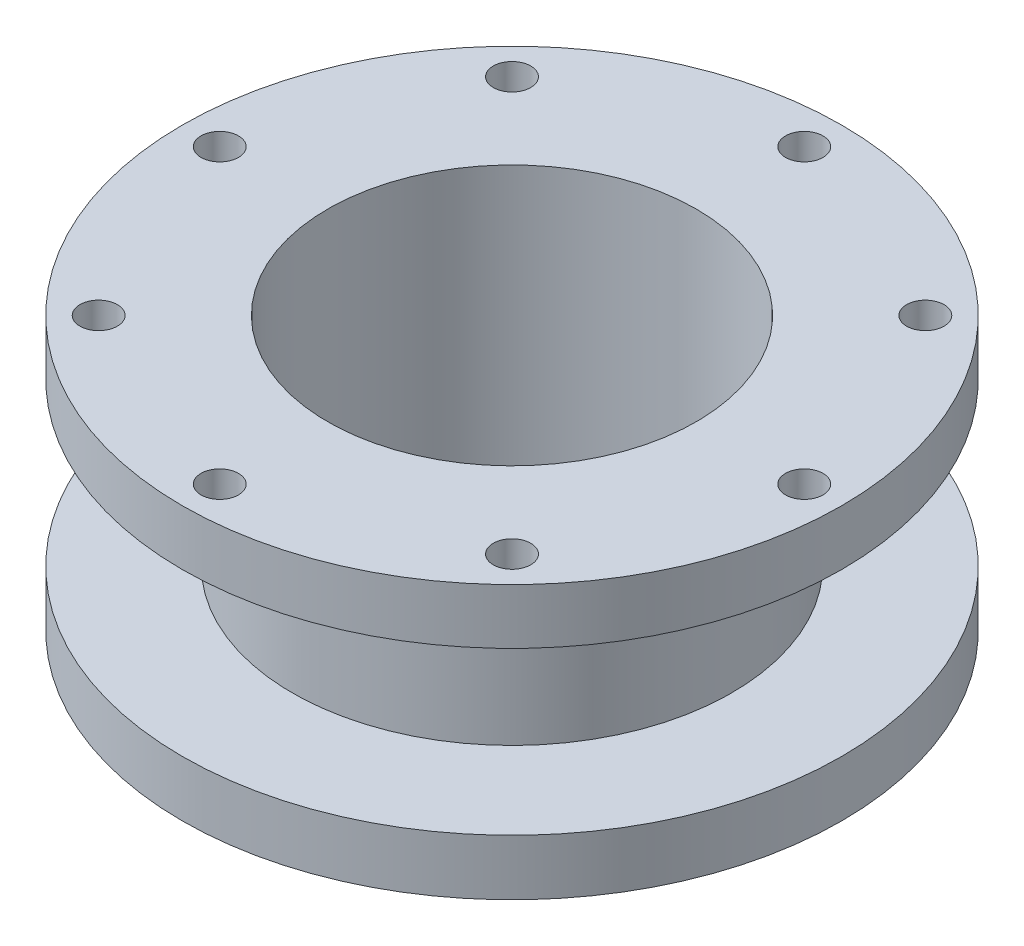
ISO-10303-21;
HEADER;
FILE_DESCRIPTION(('STEP AP214'),'2;1');
FILE_NAME('part.step','',(''),(''),'','','');
FILE_SCHEMA(('AUTOMOTIVE_DESIGN { 1 0 10303 214 1 1 1 1 }'));
ENDSEC;
DATA;
#1=APPLICATION_CONTEXT('core data for automotive mechanical design processes');
#2=APPLICATION_PROTOCOL_DEFINITION('international standard','automotive_design',2000,#1);
#3=PRODUCT_CONTEXT('',#1,'mechanical');
#4=PRODUCT('Part','Part','',(#3));
#5=PRODUCT_RELATED_PRODUCT_CATEGORY('part','',(#4));
#6=PRODUCT_DEFINITION_FORMATION('','',#4);
#7=PRODUCT_DEFINITION_CONTEXT('part definition',#1,'design');
#8=PRODUCT_DEFINITION('design','',#6,#7);
#9=PRODUCT_DEFINITION_SHAPE('','',#8);
#10=(LENGTH_UNIT() NAMED_UNIT(*) SI_UNIT(.MILLI.,.METRE.));
#11=(NAMED_UNIT(*) PLANE_ANGLE_UNIT() SI_UNIT($,.RADIAN.));
#12=(NAMED_UNIT(*) SI_UNIT($,.STERADIAN.) SOLID_ANGLE_UNIT());
#13=UNCERTAINTY_MEASURE_WITH_UNIT(LENGTH_MEASURE(1.E-05),#10,'distance_accuracy_value','');
#14=(GEOMETRIC_REPRESENTATION_CONTEXT(3) GLOBAL_UNCERTAINTY_ASSIGNED_CONTEXT((#13)) GLOBAL_UNIT_ASSIGNED_CONTEXT((#10,
#11,#12)) REPRESENTATION_CONTEXT('',''));
#15=CARTESIAN_POINT('',(0.,0.,0.));
#16=DIRECTION('',(0.,0.,1.));
#17=DIRECTION('',(1.,0.,0.));
#18=AXIS2_PLACEMENT_3D('',#15,#16,#17);
#19=CARTESIAN_POINT('',(-57.2500000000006,12.6,1.11022302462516E-13));
#20=DIRECTION('',(0.,1.,0.));
#21=DIRECTION('',(0.,0.,1.00000000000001));
#22=AXIS2_PLACEMENT_3D('',#19,#20,#21);
#23=PLANE('',#22);
#24=CARTESIAN_POINT('',(1.66533453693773E-13,12.6,0.));
#25=DIRECTION('',(0.,-1.,0.));
#26=DIRECTION('',(0.,0.,-1.00000000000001));
#27=AXIS2_PLACEMENT_3D('',#24,#25,#26);
#28=CIRCLE('',#27,32.);
#29=CARTESIAN_POINT('',(1.66533453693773E-13,12.6,-32.0000000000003));
#30=VERTEX_POINT('',#29);
#31=EDGE_CURVE('E10',#30,#30,#28,.T.);
#32=ORIENTED_EDGE('',*,*,#31,.F.);
#33=EDGE_LOOP('',(#32));
#34=FACE_BOUND('',#33,.T.);
#35=CARTESIAN_POINT('',(1.66533453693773E-13,12.6,0.));
#36=DIRECTION('',(0.,-1.,0.));
#37=DIRECTION('',(0.,0.,-1.00000000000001));
#38=AXIS2_PLACEMENT_3D('',#35,#36,#37);
#39=CIRCLE('',#38,57.25);
#40=CARTESIAN_POINT('',(1.66533453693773E-13,12.6,-57.2500000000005));
#41=VERTEX_POINT('',#40);
#42=EDGE_CURVE('E55',#41,#41,#39,.T.);
#43=ORIENTED_EDGE('',*,*,#42,.T.);
#44=EDGE_LOOP('',(#43));
#45=FACE_BOUND('',#44,.T.);
#46=ADVANCED_FACE('F36',(#34,#45),#23,.F.);
#47=CARTESIAN_POINT('',(0.,0.,0.));
#48=DIRECTION('',(0.,-1.,0.));
#49=DIRECTION('',(0.,0.,-1.00000000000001));
#50=AXIS2_PLACEMENT_3D('',#47,#48,#49);
#51=CYLINDRICAL_SURFACE('',#50,32.);
#52=CARTESIAN_POINT('',(1.11022302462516E-13,60.,0.));
#53=DIRECTION('',(0.,-1.,0.));
#54=DIRECTION('',(0.,0.,-1.00000000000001));
#55=AXIS2_PLACEMENT_3D('',#52,#53,#54);
#56=CIRCLE('',#55,32.);
#57=CARTESIAN_POINT('',(1.11022302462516E-13,60.,-32.0000000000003));
#58=VERTEX_POINT('',#57);
#59=EDGE_CURVE('E43',#58,#58,#56,.T.);
#60=ORIENTED_EDGE('',*,*,#59,.F.);
#61=EDGE_LOOP('',(#60));
#62=FACE_BOUND('',#61,.T.);
#63=ORIENTED_EDGE('',*,*,#31,.T.);
#64=EDGE_LOOP('',(#63));
#65=FACE_BOUND('',#64,.T.);
#66=ADVANCED_FACE('F122',(#62,#65),#51,.F.);
#67=CARTESIAN_POINT('',(-32.0000000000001,59.9999999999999,0.));
#68=DIRECTION('',(0.,-1.,0.));
#69=DIRECTION('',(0.,0.,-1.00000000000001));
#70=AXIS2_PLACEMENT_3D('',#67,#68,#69);
#71=PLANE('',#70);
#72=CARTESIAN_POINT('',(35.8856691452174,60.,35.8856691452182));
#73=DIRECTION('',(0.,1.,0.));
#74=DIRECTION('',(0.,0.,1.00000000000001));
#75=AXIS2_PLACEMENT_3D('',#72,#73,#74);
#76=CIRCLE('',#75,3.25);
#77=CARTESIAN_POINT('',(35.8856691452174,60.,39.1356691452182));
#78=VERTEX_POINT('',#77);
#79=EDGE_CURVE('E88',#78,#78,#76,.T.);
#80=ORIENTED_EDGE('',*,*,#79,.F.);
#81=EDGE_LOOP('',(#80));
#82=FACE_BOUND('',#81,.T.);
#83=CARTESIAN_POINT('',(50.7500000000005,59.9999999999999,5.96744875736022E-13));
#84=DIRECTION('',(0.,1.,0.));
#85=DIRECTION('',(0.,0.,1.00000000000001));
#86=AXIS2_PLACEMENT_3D('',#83,#84,#85);
#87=CIRCLE('',#86,3.25);
#88=CARTESIAN_POINT('',(50.7500000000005,59.9999999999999,3.25000000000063));
#89=VERTEX_POINT('',#88);
#90=EDGE_CURVE('E78',#89,#89,#87,.T.);
#91=ORIENTED_EDGE('',*,*,#90,.F.);
#92=EDGE_LOOP('',(#91));
#93=FACE_BOUND('',#92,.T.);
#94=CARTESIAN_POINT('',(35.8856691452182,60.0000000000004,-35.8856691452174));
#95=DIRECTION('',(0.,1.,0.));
#96=DIRECTION('',(0.,0.,1.00000000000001));
#97=AXIS2_PLACEMENT_3D('',#94,#95,#96);
#98=CIRCLE('',#97,3.25);
#99=CARTESIAN_POINT('',(35.8856691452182,60.0000000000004,-32.6356691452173));
#100=VERTEX_POINT('',#99);
#101=EDGE_CURVE('E75',#100,#100,#98,.T.);
#102=ORIENTED_EDGE('',*,*,#101,.F.);
#103=EDGE_LOOP('',(#102));
#104=FACE_BOUND('',#103,.T.);
#105=CARTESIAN_POINT('',(1.66533453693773E-13,59.9999999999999,-50.7500000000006));
#106=DIRECTION('',(0.,1.,0.));
#107=DIRECTION('',(0.,0.,1.00000000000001));
#108=AXIS2_PLACEMENT_3D('',#105,#106,#107);
#109=CIRCLE('',#108,3.25);
#110=CARTESIAN_POINT('',(1.66533453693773E-13,59.9999999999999,-47.5000000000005));
#111=VERTEX_POINT('',#110);
#112=EDGE_CURVE('E72',#111,#111,#109,.T.);
#113=ORIENTED_EDGE('',*,*,#112,.F.);
#114=EDGE_LOOP('',(#113));
#115=FACE_BOUND('',#114,.T.);
#116=CARTESIAN_POINT('',(-35.8856691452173,60.,-35.8856691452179));
#117=DIRECTION('',(0.,1.,0.));
#118=DIRECTION('',(0.,0.,1.00000000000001));
#119=AXIS2_PLACEMENT_3D('',#116,#117,#118);
#120=CIRCLE('',#119,3.25);
#121=CARTESIAN_POINT('',(-35.8856691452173,60.,-32.6356691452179));
#122=VERTEX_POINT('',#121);
#123=EDGE_CURVE('E68',#122,#122,#120,.T.);
#124=ORIENTED_EDGE('',*,*,#123,.F.);
#125=EDGE_LOOP('',(#124));
#126=FACE_BOUND('',#125,.T.);
#127=CARTESIAN_POINT('',(-50.7500000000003,59.9999999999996,-3.60822483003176E-13));
#128=DIRECTION('',(0.,1.,0.));
#129=DIRECTION('',(0.,0.,1.00000000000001));
#130=AXIS2_PLACEMENT_3D('',#127,#128,#129);
#131=CIRCLE('',#130,3.25);
#132=CARTESIAN_POINT('',(-50.7500000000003,59.9999999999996,3.24999999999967));
#133=VERTEX_POINT('',#132);
#134=EDGE_CURVE('E64',#133,#133,#131,.T.);
#135=ORIENTED_EDGE('',*,*,#134,.F.);
#136=EDGE_LOOP('',(#135));
#137=FACE_BOUND('',#136,.T.);
#138=CARTESIAN_POINT('',(-35.8856691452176,60.0000000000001,35.8856691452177));
#139=DIRECTION('',(0.,1.,0.));
#140=DIRECTION('',(0.,0.,1.00000000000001));
#141=AXIS2_PLACEMENT_3D('',#138,#139,#140);
#142=CIRCLE('',#141,3.25);
#143=CARTESIAN_POINT('',(-35.8856691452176,60.0000000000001,39.1356691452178));
#144=VERTEX_POINT('',#143);
#145=EDGE_CURVE('E60',#144,#144,#142,.T.);
#146=ORIENTED_EDGE('',*,*,#145,.F.);
#147=EDGE_LOOP('',(#146));
#148=FACE_BOUND('',#147,.T.);
#149=CARTESIAN_POINT('',(1.66533453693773E-13,59.9999999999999,50.7500000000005));
#150=DIRECTION('',(0.,1.,0.));
#151=DIRECTION('',(0.,0.,1.00000000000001));
#152=AXIS2_PLACEMENT_3D('',#149,#150,#151);
#153=CIRCLE('',#152,3.25);
#154=CARTESIAN_POINT('',(1.66533453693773E-13,59.9999999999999,54.0000000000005));
#155=VERTEX_POINT('',#154);
#156=EDGE_CURVE('E56',#155,#155,#153,.T.);
#157=ORIENTED_EDGE('',*,*,#156,.F.);
#158=EDGE_LOOP('',(#157));
#159=FACE_BOUND('',#158,.T.);
#160=CARTESIAN_POINT('',(1.11022302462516E-13,60.,0.));
#161=DIRECTION('',(0.,-1.,0.));
#162=DIRECTION('',(0.,0.,-1.00000000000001));
#163=AXIS2_PLACEMENT_3D('',#160,#161,#162);
#164=CIRCLE('',#163,57.25);
#165=CARTESIAN_POINT('',(1.11022302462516E-13,60.,-57.2500000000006));
#166=VERTEX_POINT('',#165);
#167=EDGE_CURVE('E48',#166,#166,#164,.T.);
#168=ORIENTED_EDGE('',*,*,#167,.F.);
#169=EDGE_LOOP('',(#168));
#170=FACE_BOUND('',#169,.T.);
#171=ORIENTED_EDGE('',*,*,#59,.T.);
#172=EDGE_LOOP('',(#171));
#173=FACE_BOUND('',#172,.T.);
#174=ADVANCED_FACE('F119',(#82,#93,#104,#115,#126,#137,#148,#159,#170,#173),#71,.F.);
#175=CARTESIAN_POINT('',(0.,0.,0.));
#176=DIRECTION('',(0.,-1.,0.));
#177=DIRECTION('',(0.,0.,-1.00000000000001));
#178=AXIS2_PLACEMENT_3D('',#175,#176,#177);
#179=CYLINDRICAL_SURFACE('',#178,57.25);
#180=CARTESIAN_POINT('',(0.,50.4,1.38777878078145E-13));
#181=DIRECTION('',(0.,-1.,0.));
#182=DIRECTION('',(0.,0.,-1.00000000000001));
#183=AXIS2_PLACEMENT_3D('',#180,#181,#182);
#184=CIRCLE('',#183,57.25);
#185=CARTESIAN_POINT('',(0.,50.4,-57.2500000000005));
#186=VERTEX_POINT('',#185);
#187=EDGE_CURVE('E112',#186,#186,#184,.T.);
#188=ORIENTED_EDGE('',*,*,#187,.F.);
#189=EDGE_LOOP('',(#188));
#190=FACE_BOUND('',#189,.T.);
#191=ORIENTED_EDGE('',*,*,#167,.T.);
#192=EDGE_LOOP('',(#191));
#193=FACE_BOUND('',#192,.T.);
#194=ADVANCED_FACE('F117',(#190,#193),#179,.T.);
#195=CARTESIAN_POINT('',(-57.2500000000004,50.3999999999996,0.));
#196=DIRECTION('',(0.,1.,0.));
#197=DIRECTION('',(0.,0.,1.00000000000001));
#198=AXIS2_PLACEMENT_3D('',#195,#196,#197);
#199=PLANE('',#198);
#200=CARTESIAN_POINT('',(35.8856691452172,50.4,35.8856691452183));
#201=DIRECTION('',(0.,1.,0.));
#202=DIRECTION('',(0.,0.,1.00000000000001));
#203=AXIS2_PLACEMENT_3D('',#200,#201,#202);
#204=CIRCLE('',#203,3.25);
#205=CARTESIAN_POINT('',(35.8856691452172,50.4,39.1356691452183));
#206=VERTEX_POINT('',#205);
#207=EDGE_CURVE('E39',#206,#206,#204,.T.);
#208=ORIENTED_EDGE('',*,*,#207,.T.);
#209=EDGE_LOOP('',(#208));
#210=FACE_BOUND('',#209,.T.);
#211=CARTESIAN_POINT('',(50.7500000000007,50.3999999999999,5.55111512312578E-13));
#212=DIRECTION('',(0.,1.,0.));
#213=DIRECTION('',(0.,0.,1.00000000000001));
#214=AXIS2_PLACEMENT_3D('',#211,#212,#213);
#215=CIRCLE('',#214,3.24999999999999);
#216=CARTESIAN_POINT('',(50.7500000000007,50.3999999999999,3.25000000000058));
#217=VERTEX_POINT('',#216);
#218=EDGE_CURVE('E76',#217,#217,#215,.T.);
#219=ORIENTED_EDGE('',*,*,#218,.T.);
#220=EDGE_LOOP('',(#219));
#221=FACE_BOUND('',#220,.T.);
#222=CARTESIAN_POINT('',(35.885669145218,50.4000000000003,-35.8856691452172));
#223=DIRECTION('',(0.,1.,0.));
#224=DIRECTION('',(0.,0.,1.00000000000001));
#225=AXIS2_PLACEMENT_3D('',#222,#223,#224);
#226=CIRCLE('',#225,3.25);
#227=CARTESIAN_POINT('',(35.885669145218,50.4000000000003,-32.6356691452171));
#228=VERTEX_POINT('',#227);
#229=EDGE_CURVE('E73',#228,#228,#226,.T.);
#230=ORIENTED_EDGE('',*,*,#229,.T.);
#231=EDGE_LOOP('',(#230));
#232=FACE_BOUND('',#231,.T.);
#233=CARTESIAN_POINT('',(0.,50.3999999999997,-50.7500000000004));
#234=DIRECTION('',(0.,1.,0.));
#235=DIRECTION('',(0.,0.,1.00000000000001));
#236=AXIS2_PLACEMENT_3D('',#233,#234,#235);
#237=CIRCLE('',#236,3.24999999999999);
#238=CARTESIAN_POINT('',(0.,50.3999999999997,-47.5000000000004));
#239=VERTEX_POINT('',#238);
#240=EDGE_CURVE('E69',#239,#239,#237,.T.);
#241=ORIENTED_EDGE('',*,*,#240,.T.);
#242=EDGE_LOOP('',(#241));
#243=FACE_BOUND('',#242,.T.);
#244=CARTESIAN_POINT('',(-35.8856691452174,50.4,-35.8856691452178));
#245=DIRECTION('',(0.,1.,0.));
#246=DIRECTION('',(0.,0.,1.00000000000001));
#247=AXIS2_PLACEMENT_3D('',#244,#245,#246);
#248=CIRCLE('',#247,3.24999999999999);
#249=CARTESIAN_POINT('',(-35.8856691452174,50.4,-32.6356691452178));
#250=VERTEX_POINT('',#249);
#251=EDGE_CURVE('E65',#250,#250,#248,.T.);
#252=ORIENTED_EDGE('',*,*,#251,.T.);
#253=EDGE_LOOP('',(#252));
#254=FACE_BOUND('',#253,.T.);
#255=CARTESIAN_POINT('',(-50.7500000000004,50.3999999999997,-1.2490009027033E-13));
#256=DIRECTION('',(0.,1.,0.));
#257=DIRECTION('',(0.,0.,1.00000000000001));
#258=AXIS2_PLACEMENT_3D('',#255,#256,#257);
#259=CIRCLE('',#258,3.24999999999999);
#260=CARTESIAN_POINT('',(-50.7500000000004,50.3999999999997,3.2499999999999));
#261=VERTEX_POINT('',#260);
#262=EDGE_CURVE('E61',#261,#261,#259,.T.);
#263=ORIENTED_EDGE('',*,*,#262,.T.);
#264=EDGE_LOOP('',(#263));
#265=FACE_BOUND('',#264,.T.);
#266=CARTESIAN_POINT('',(-35.8856691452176,50.4000000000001,35.8856691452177));
#267=DIRECTION('',(0.,1.,0.));
#268=DIRECTION('',(0.,0.,1.00000000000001));
#269=AXIS2_PLACEMENT_3D('',#266,#267,#268);
#270=CIRCLE('',#269,3.25);
#271=CARTESIAN_POINT('',(-35.8856691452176,50.4000000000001,39.1356691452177));
#272=VERTEX_POINT('',#271);
#273=EDGE_CURVE('E57',#272,#272,#270,.T.);
#274=ORIENTED_EDGE('',*,*,#273,.T.);
#275=EDGE_LOOP('',(#274));
#276=FACE_BOUND('',#275,.T.);
#277=CARTESIAN_POINT('',(-1.11022302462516E-13,50.4000000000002,50.7500000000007));
#278=DIRECTION('',(0.,1.,0.));
#279=DIRECTION('',(0.,0.,1.00000000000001));
#280=AXIS2_PLACEMENT_3D('',#277,#278,#279);
#281=CIRCLE('',#280,3.24999999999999);
#282=CARTESIAN_POINT('',(-1.11022302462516E-13,50.4000000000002,54.0000000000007));
#283=VERTEX_POINT('',#282);
#284=EDGE_CURVE('E52',#283,#283,#281,.T.);
#285=ORIENTED_EDGE('',*,*,#284,.T.);
#286=EDGE_LOOP('',(#285));
#287=FACE_BOUND('',#286,.T.);
#288=CARTESIAN_POINT('',(0.,50.4,1.38777878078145E-13));
#289=DIRECTION('',(0.,-1.,0.));
#290=DIRECTION('',(0.,0.,-1.00000000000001));
#291=AXIS2_PLACEMENT_3D('',#288,#289,#290);
#292=CIRCLE('',#291,38.15);
#293=CARTESIAN_POINT('',(0.,50.4,-38.1500000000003));
#294=VERTEX_POINT('',#293);
#295=EDGE_CURVE('E109',#294,#294,#292,.T.);
#296=ORIENTED_EDGE('',*,*,#295,.F.);
#297=EDGE_LOOP('',(#296));
#298=FACE_BOUND('',#297,.T.);
#299=ORIENTED_EDGE('',*,*,#187,.T.);
#300=EDGE_LOOP('',(#299));
#301=FACE_BOUND('',#300,.T.);
#302=ADVANCED_FACE('F135',(#210,#221,#232,#243,#254,#265,#276,#287,#298,#301),#199,.F.);
#303=CARTESIAN_POINT('',(0.,0.,0.));
#304=DIRECTION('',(0.,-1.,0.));
#305=DIRECTION('',(0.,0.,-1.00000000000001));
#306=AXIS2_PLACEMENT_3D('',#303,#304,#305);
#307=CYLINDRICAL_SURFACE('',#306,38.15);
#308=CARTESIAN_POINT('',(0.,22.3,0.));
#309=DIRECTION('',(0.,-1.,0.));
#310=DIRECTION('',(0.,0.,-1.00000000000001));
#311=AXIS2_PLACEMENT_3D('',#308,#309,#310);
#312=CIRCLE('',#311,38.15);
#313=CARTESIAN_POINT('',(0.,22.3,-38.1500000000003));
#314=VERTEX_POINT('',#313);
#315=EDGE_CURVE('E106',#314,#314,#312,.T.);
#316=ORIENTED_EDGE('',*,*,#315,.F.);
#317=EDGE_LOOP('',(#316));
#318=FACE_BOUND('',#317,.T.);
#319=ORIENTED_EDGE('',*,*,#295,.T.);
#320=EDGE_LOOP('',(#319));
#321=FACE_BOUND('',#320,.T.);
#322=ADVANCED_FACE('F139',(#318,#321),#307,.T.);
#323=CARTESIAN_POINT('',(-38.1500000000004,22.2999999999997,0.));
#324=DIRECTION('',(0.,-1.,0.));
#325=DIRECTION('',(0.,0.,-1.00000000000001));
#326=AXIS2_PLACEMENT_3D('',#323,#324,#325);
#327=PLANE('',#326);
#328=CARTESIAN_POINT('',(0.,22.3,0.));
#329=DIRECTION('',(0.,-1.,0.));
#330=DIRECTION('',(0.,0.,-1.00000000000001));
#331=AXIS2_PLACEMENT_3D('',#328,#329,#330);
#332=CIRCLE('',#331,57.25);
#333=CARTESIAN_POINT('',(0.,22.3,-57.2500000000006));
#334=VERTEX_POINT('',#333);
#335=EDGE_CURVE('E103',#334,#334,#332,.T.);
#336=ORIENTED_EDGE('',*,*,#335,.F.);
#337=EDGE_LOOP('',(#336));
#338=FACE_BOUND('',#337,.T.);
#339=ORIENTED_EDGE('',*,*,#315,.T.);
#340=EDGE_LOOP('',(#339));
#341=FACE_BOUND('',#340,.T.);
#342=ADVANCED_FACE('F143',(#338,#341),#327,.F.);
#343=CARTESIAN_POINT('',(0.,0.,0.));
#344=DIRECTION('',(0.,-1.,0.));
#345=DIRECTION('',(0.,0.,-1.00000000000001));
#346=AXIS2_PLACEMENT_3D('',#343,#344,#345);
#347=CYLINDRICAL_SURFACE('',#346,57.25);
#348=ORIENTED_EDGE('',*,*,#42,.F.);
#349=EDGE_LOOP('',(#348));
#350=FACE_BOUND('',#349,.T.);
#351=ORIENTED_EDGE('',*,*,#335,.T.);
#352=EDGE_LOOP('',(#351));
#353=FACE_BOUND('',#352,.T.);
#354=ADVANCED_FACE('F147',(#350,#353),#347,.T.);
#355=CARTESIAN_POINT('',(1.66533453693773E-13,59.9999999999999,50.7500000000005));
#356=DIRECTION('',(0.,1.,0.));
#357=DIRECTION('',(0.,0.,1.00000000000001));
#358=AXIS2_PLACEMENT_3D('',#355,#356,#357);
#359=CYLINDRICAL_SURFACE('',#358,3.24999999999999);
#360=ORIENTED_EDGE('',*,*,#156,.T.);
#361=EDGE_LOOP('',(#360));
#362=FACE_BOUND('',#361,.T.);
#363=ORIENTED_EDGE('',*,*,#284,.F.);
#364=EDGE_LOOP('',(#363));
#365=FACE_BOUND('',#364,.T.);
#366=ADVANCED_FACE('F151',(#362,#365),#359,.F.);
#367=CARTESIAN_POINT('',(-35.8856691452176,60.0000000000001,35.8856691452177));
#368=DIRECTION('',(0.,1.,0.));
#369=DIRECTION('',(0.,0.,1.00000000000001));
#370=AXIS2_PLACEMENT_3D('',#367,#368,#369);
#371=CYLINDRICAL_SURFACE('',#370,3.25);
#372=ORIENTED_EDGE('',*,*,#145,.T.);
#373=EDGE_LOOP('',(#372));
#374=FACE_BOUND('',#373,.T.);
#375=ORIENTED_EDGE('',*,*,#273,.F.);
#376=EDGE_LOOP('',(#375));
#377=FACE_BOUND('',#376,.T.);
#378=ADVANCED_FACE('F155',(#374,#377),#371,.F.);
#379=CARTESIAN_POINT('',(-50.7500000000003,59.9999999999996,-3.60822483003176E-13));
#380=DIRECTION('',(0.,1.,0.));
#381=DIRECTION('',(0.,0.,1.00000000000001));
#382=AXIS2_PLACEMENT_3D('',#379,#380,#381);
#383=CYLINDRICAL_SURFACE('',#382,3.24999999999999);
#384=ORIENTED_EDGE('',*,*,#134,.T.);
#385=EDGE_LOOP('',(#384));
#386=FACE_BOUND('',#385,.T.);
#387=ORIENTED_EDGE('',*,*,#262,.F.);
#388=EDGE_LOOP('',(#387));
#389=FACE_BOUND('',#388,.T.);
#390=ADVANCED_FACE('F159',(#386,#389),#383,.F.);
#391=CARTESIAN_POINT('',(-35.8856691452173,60.,-35.8856691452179));
#392=DIRECTION('',(0.,1.,0.));
#393=DIRECTION('',(0.,0.,1.00000000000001));
#394=AXIS2_PLACEMENT_3D('',#391,#392,#393);
#395=CYLINDRICAL_SURFACE('',#394,3.24999999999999);
#396=ORIENTED_EDGE('',*,*,#123,.T.);
#397=EDGE_LOOP('',(#396));
#398=FACE_BOUND('',#397,.T.);
#399=ORIENTED_EDGE('',*,*,#251,.F.);
#400=EDGE_LOOP('',(#399));
#401=FACE_BOUND('',#400,.T.);
#402=ADVANCED_FACE('F163',(#398,#401),#395,.F.);
#403=CARTESIAN_POINT('',(1.66533453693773E-13,59.9999999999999,-50.7500000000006));
#404=DIRECTION('',(0.,1.,0.));
#405=DIRECTION('',(0.,0.,1.00000000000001));
#406=AXIS2_PLACEMENT_3D('',#403,#404,#405);
#407=CYLINDRICAL_SURFACE('',#406,3.24999999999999);
#408=ORIENTED_EDGE('',*,*,#112,.T.);
#409=EDGE_LOOP('',(#408));
#410=FACE_BOUND('',#409,.T.);
#411=ORIENTED_EDGE('',*,*,#240,.F.);
#412=EDGE_LOOP('',(#411));
#413=FACE_BOUND('',#412,.T.);
#414=ADVANCED_FACE('F167',(#410,#413),#407,.F.);
#415=CARTESIAN_POINT('',(35.8856691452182,60.0000000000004,-35.8856691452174));
#416=DIRECTION('',(0.,1.,0.));
#417=DIRECTION('',(0.,0.,1.00000000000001));
#418=AXIS2_PLACEMENT_3D('',#415,#416,#417);
#419=CYLINDRICAL_SURFACE('',#418,3.25);
#420=ORIENTED_EDGE('',*,*,#101,.T.);
#421=EDGE_LOOP('',(#420));
#422=FACE_BOUND('',#421,.T.);
#423=ORIENTED_EDGE('',*,*,#229,.F.);
#424=EDGE_LOOP('',(#423));
#425=FACE_BOUND('',#424,.T.);
#426=ADVANCED_FACE('F171',(#422,#425),#419,.F.);
#427=CARTESIAN_POINT('',(50.7500000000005,59.9999999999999,5.96744875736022E-13));
#428=DIRECTION('',(0.,1.,0.));
#429=DIRECTION('',(0.,0.,1.00000000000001));
#430=AXIS2_PLACEMENT_3D('',#427,#428,#429);
#431=CYLINDRICAL_SURFACE('',#430,3.24999999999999);
#432=ORIENTED_EDGE('',*,*,#90,.T.);
#433=EDGE_LOOP('',(#432));
#434=FACE_BOUND('',#433,.T.);
#435=ORIENTED_EDGE('',*,*,#218,.F.);
#436=EDGE_LOOP('',(#435));
#437=FACE_BOUND('',#436,.T.);
#438=ADVANCED_FACE('F175',(#434,#437),#431,.F.);
#439=CARTESIAN_POINT('',(35.8856691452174,60.,35.8856691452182));
#440=DIRECTION('',(0.,1.,0.));
#441=DIRECTION('',(0.,0.,1.00000000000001));
#442=AXIS2_PLACEMENT_3D('',#439,#440,#441);
#443=CYLINDRICAL_SURFACE('',#442,3.25);
#444=ORIENTED_EDGE('',*,*,#79,.T.);
#445=EDGE_LOOP('',(#444));
#446=FACE_BOUND('',#445,.T.);
#447=ORIENTED_EDGE('',*,*,#207,.F.);
#448=EDGE_LOOP('',(#447));
#449=FACE_BOUND('',#448,.T.);
#450=ADVANCED_FACE('F179',(#446,#449),#443,.F.);
#451=CLOSED_SHELL('',(#46,#66,#174,#194,#302,#322,#342,#354,#366,#378,#390,#402,#414,#426,#438,#450));
#452=MANIFOLD_SOLID_BREP('B2',#451);
#453=ADVANCED_BREP_SHAPE_REPRESENTATION('',(#18,#452),#14);
#454=SHAPE_DEFINITION_REPRESENTATION(#9,#453);
ENDSEC;
END-ISO-10303-21;
